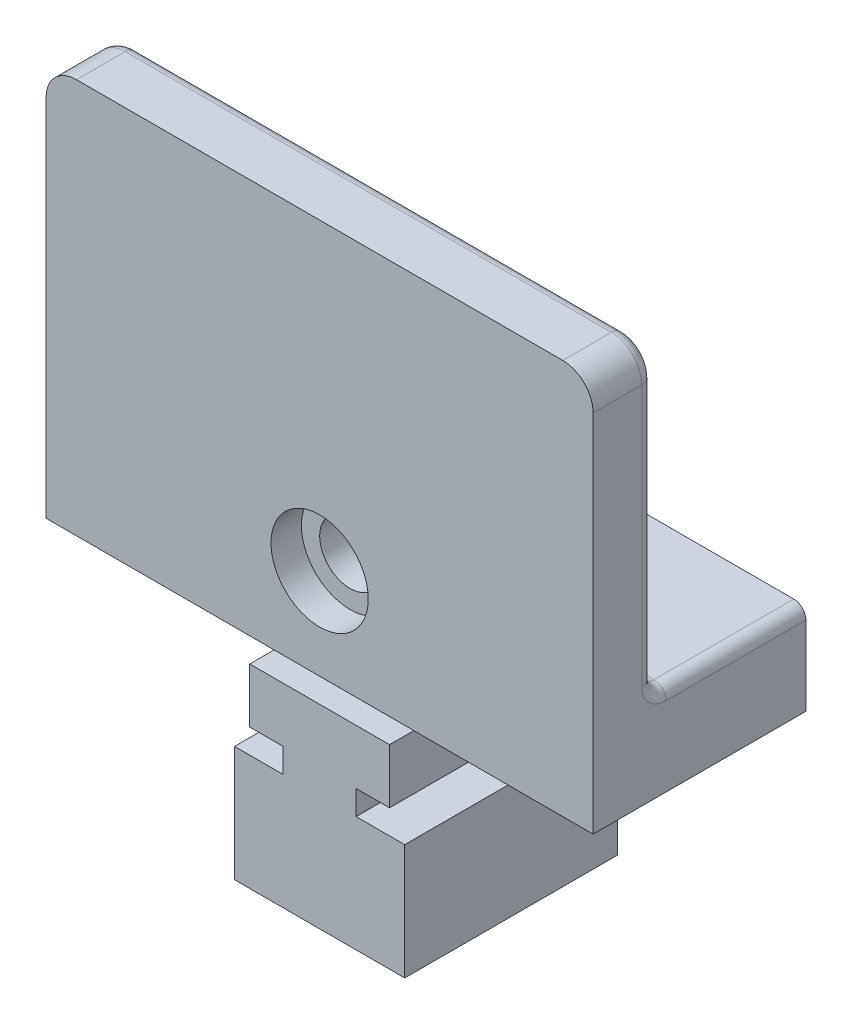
ISO-10303-21;
HEADER;
FILE_DESCRIPTION(('STEP AP214'),'2;1');
FILE_NAME('part.step','',(''),(''),'','','');
FILE_SCHEMA(('AUTOMOTIVE_DESIGN { 1 0 10303 214 1 1 1 1 }'));
ENDSEC;
DATA;
#1=APPLICATION_CONTEXT('core data for automotive mechanical design processes');
#2=APPLICATION_PROTOCOL_DEFINITION('international standard','automotive_design',2000,#1);
#3=PRODUCT_CONTEXT('',#1,'mechanical');
#4=PRODUCT('Part','Part','',(#3));
#5=PRODUCT_RELATED_PRODUCT_CATEGORY('part','',(#4));
#6=PRODUCT_DEFINITION_FORMATION('','',#4);
#7=PRODUCT_DEFINITION_CONTEXT('part definition',#1,'design');
#8=PRODUCT_DEFINITION('design','',#6,#7);
#9=PRODUCT_DEFINITION_SHAPE('','',#8);
#10=(LENGTH_UNIT() NAMED_UNIT(*) SI_UNIT(.MILLI.,.METRE.));
#11=(NAMED_UNIT(*) PLANE_ANGLE_UNIT() SI_UNIT($,.RADIAN.));
#12=(NAMED_UNIT(*) SI_UNIT($,.STERADIAN.) SOLID_ANGLE_UNIT());
#13=UNCERTAINTY_MEASURE_WITH_UNIT(LENGTH_MEASURE(1.E-05),#10,'distance_accuracy_value','');
#14=(GEOMETRIC_REPRESENTATION_CONTEXT(3) GLOBAL_UNCERTAINTY_ASSIGNED_CONTEXT((#13)) GLOBAL_UNIT_ASSIGNED_CONTEXT((#10,
#11,#12)) REPRESENTATION_CONTEXT('',''));
#15=CARTESIAN_POINT('',(0.,0.,0.));
#16=DIRECTION('',(0.,0.,1.));
#17=DIRECTION('',(1.,0.,0.));
#18=AXIS2_PLACEMENT_3D('',#15,#16,#17);
#19=CARTESIAN_POINT('',(-18.8944436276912,57.,25.));
#20=DIRECTION('',(0.,0.,1.));
#21=DIRECTION('',(1.,0.,0.));
#22=AXIS2_PLACEMENT_3D('',#19,#20,#21);
#23=PLANE('',#22);
#24=DIRECTION('',(0.,-1.,0.));
#25=VECTOR('',#24,1.);
#26=CARTESIAN_POINT('',(-11.5,40.,25.));
#27=LINE('',#26,#25);
#28=CARTESIAN_POINT('',(-11.5,40.,25.));
#29=VERTEX_POINT('',#28);
#30=CARTESIAN_POINT('',(-11.5,36.,25.));
#31=VERTEX_POINT('',#30);
#32=EDGE_CURVE('E390',#29,#31,#27,.T.);
#33=ORIENTED_EDGE('',*,*,#32,.T.);
#34=DIRECTION('',(-1.,0.,0.));
#35=VECTOR('',#34,1.);
#36=CARTESIAN_POINT('',(-11.5,36.,25.));
#37=LINE('',#36,#35);
#38=CARTESIAN_POINT('',(11.5,36.,25.));
#39=VERTEX_POINT('',#38);
#40=EDGE_CURVE('E257',#39,#31,#37,.T.);
#41=ORIENTED_EDGE('',*,*,#40,.F.);
#42=DIRECTION('',(0.,1.,0.));
#43=VECTOR('',#42,1.);
#44=CARTESIAN_POINT('',(11.5,40.,25.));
#45=LINE('',#44,#43);
#46=CARTESIAN_POINT('',(11.5,40.,25.));
#47=VERTEX_POINT('',#46);
#48=EDGE_CURVE('E36',#39,#47,#45,.T.);
#49=ORIENTED_EDGE('',*,*,#48,.T.);
#50=DIRECTION('',(1.,0.,0.));
#51=VECTOR('',#50,1.);
#52=CARTESIAN_POINT('',(12.5,40.,25.));
#53=LINE('',#52,#51);
#54=EDGE_CURVE('E442',#29,#47,#53,.T.);
#55=ORIENTED_EDGE('',*,*,#54,.F.);
#56=EDGE_LOOP('',(#33,#41,#49,#55));
#57=FACE_BOUND('',#56,.T.);
#58=ADVANCED_FACE('F32',(#57),#23,.T.);
#59=CARTESIAN_POINT('',(0.,55.,35.));
#60=DIRECTION('',(0.,0.,-1.));
#61=DIRECTION('',(-1.,0.,0.));
#62=AXIS2_PLACEMENT_3D('',#59,#60,#61);
#63=CYLINDRICAL_SURFACE('',#62,5.);
#64=CARTESIAN_POINT('',(0.,55.,0.));
#65=DIRECTION('',(0.,0.,-1.));
#66=DIRECTION('',(-1.,0.,0.));
#67=AXIS2_PLACEMENT_3D('',#64,#65,#66);
#68=CIRCLE('',#67,5.);
#69=CARTESIAN_POINT('',(-5.,55.,0.));
#70=VERTEX_POINT('',#69);
#71=EDGE_CURVE('E308',#70,#70,#68,.T.);
#72=ORIENTED_EDGE('',*,*,#71,.T.);
#73=EDGE_LOOP('',(#72));
#74=FACE_BOUND('',#73,.T.);
#75=CARTESIAN_POINT('',(0.,55.,30.));
#76=DIRECTION('',(0.,0.,1.));
#77=DIRECTION('',(1.,0.,0.));
#78=AXIS2_PLACEMENT_3D('',#75,#76,#77);
#79=CIRCLE('',#78,5.);
#80=CARTESIAN_POINT('',(5.,55.,30.));
#81=VERTEX_POINT('',#80);
#82=EDGE_CURVE('E306',#81,#81,#79,.F.);
#83=ORIENTED_EDGE('',*,*,#82,.F.);
#84=EDGE_LOOP('',(#83));
#85=FACE_BOUND('',#84,.T.);
#86=ADVANCED_FACE('F527',(#74,#85),#63,.F.);
#87=CARTESIAN_POINT('',(-18.8944436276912,57.,25.));
#88=DIRECTION('',(0.,0.,-1.));
#89=DIRECTION('',(-1.,0.,0.));
#90=AXIS2_PLACEMENT_3D('',#87,#88,#89);
#91=CYLINDRICAL_SURFACE('',#90,2.);
#92=DIRECTION('',(0.,0.,-1.));
#93=VECTOR('',#92,1.);
#94=CARTESIAN_POINT('',(-18.8944436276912,55.,25.));
#95=LINE('',#94,#93);
#96=CARTESIAN_POINT('',(-18.8944436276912,55.,23.));
#97=VERTEX_POINT('',#96);
#98=CARTESIAN_POINT('',(-18.8944436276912,55.,0.));
#99=VERTEX_POINT('',#98);
#100=EDGE_CURVE('E440',#97,#99,#95,.T.);
#101=ORIENTED_EDGE('',*,*,#100,.F.);
#102=CARTESIAN_POINT('',(-18.8944436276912,57.,23.));
#103=DIRECTION('',(0.,0.,-1.));
#104=DIRECTION('',(-1.,0.,0.));
#105=AXIS2_PLACEMENT_3D('',#102,#103,#104);
#106=CIRCLE('',#105,2.);
#107=CARTESIAN_POINT('',(-16.9055548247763,56.7894736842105,23.));
#108=VERTEX_POINT('',#107);
#109=EDGE_CURVE('E58',#97,#108,#106,.F.);
#110=ORIENTED_EDGE('',*,*,#109,.T.);
#111=DIRECTION('',(0.,0.,-1.));
#112=VECTOR('',#111,1.);
#113=CARTESIAN_POINT('',(-16.9055548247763,56.7894736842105,25.));
#114=LINE('',#113,#112);
#115=CARTESIAN_POINT('',(-16.9055548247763,56.7894736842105,0.));
#116=VERTEX_POINT('',#115);
#117=EDGE_CURVE('E391',#108,#116,#114,.T.);
#118=ORIENTED_EDGE('',*,*,#117,.T.);
#119=CARTESIAN_POINT('',(-18.8944436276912,57.,0.));
#120=DIRECTION('',(0.,0.,-1.));
#121=DIRECTION('',(1.,0.,0.));
#122=AXIS2_PLACEMENT_3D('',#119,#120,#121);
#123=CIRCLE('',#122,2.);
#124=EDGE_CURVE('E338',#116,#99,#123,.T.);
#125=ORIENTED_EDGE('',*,*,#124,.T.);
#126=EDGE_LOOP('',(#101,#110,#118,#125));
#127=FACE_BOUND('',#126,.T.);
#128=ADVANCED_FACE('F529',(#127),#91,.F.);
#129=CARTESIAN_POINT('',(-18.8944436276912,55.,25.));
#130=DIRECTION('',(0.,-1.,0.));
#131=DIRECTION('',(1.,0.,0.));
#132=AXIS2_PLACEMENT_3D('',#129,#130,#131);
#133=PLANE('',#132);
#134=DIRECTION('',(0.,0.,-1.));
#135=VECTOR('',#134,1.);
#136=CARTESIAN_POINT('',(-43.,55.,25.));
#137=LINE('',#136,#135);
#138=CARTESIAN_POINT('',(-43.,55.,23.));
#139=VERTEX_POINT('',#138);
#140=CARTESIAN_POINT('',(-43.,55.,0.));
#141=VERTEX_POINT('',#140);
#142=EDGE_CURVE('E438',#139,#141,#137,.T.);
#143=ORIENTED_EDGE('',*,*,#142,.F.);
#144=DIRECTION('',(-1.,0.,0.));
#145=VECTOR('',#144,1.);
#146=CARTESIAN_POINT('',(-18.8944436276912,55.,23.));
#147=LINE('',#146,#145);
#148=EDGE_CURVE('E482',#139,#97,#147,.F.);
#149=ORIENTED_EDGE('',*,*,#148,.T.);
#150=ORIENTED_EDGE('',*,*,#100,.T.);
#151=DIRECTION('',(-1.,0.,0.));
#152=VECTOR('',#151,1.);
#153=CARTESIAN_POINT('',(-18.8944436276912,55.,0.));
#154=LINE('',#153,#152);
#155=EDGE_CURVE('E341',#99,#141,#154,.T.);
#156=ORIENTED_EDGE('',*,*,#155,.T.);
#157=EDGE_LOOP('',(#143,#149,#150,#156));
#158=FACE_BOUND('',#157,.T.);
#159=ADVANCED_FACE('F536',(#158),#133,.F.);
#160=CARTESIAN_POINT('',(-43.,53.,25.));
#161=DIRECTION('',(0.,0.,-1.));
#162=DIRECTION('',(-1.,0.,0.));
#163=AXIS2_PLACEMENT_3D('',#160,#161,#162);
#164=CYLINDRICAL_SURFACE('',#163,2.);
#165=DIRECTION('',(0.,0.,-1.));
#166=VECTOR('',#165,1.);
#167=CARTESIAN_POINT('',(-45.,53.,25.));
#168=LINE('',#167,#166);
#169=CARTESIAN_POINT('',(-45.,53.,23.));
#170=VERTEX_POINT('',#169);
#171=CARTESIAN_POINT('',(-45.,53.,0.));
#172=VERTEX_POINT('',#171);
#173=EDGE_CURVE('E437',#170,#172,#168,.T.);
#174=ORIENTED_EDGE('',*,*,#173,.F.);
#175=CARTESIAN_POINT('',(-43.,53.,23.));
#176=DIRECTION('',(0.,0.,-1.));
#177=DIRECTION('',(-1.,0.,0.));
#178=AXIS2_PLACEMENT_3D('',#175,#176,#177);
#179=CIRCLE('',#178,2.);
#180=EDGE_CURVE('E480',#170,#139,#179,.T.);
#181=ORIENTED_EDGE('',*,*,#180,.T.);
#182=ORIENTED_EDGE('',*,*,#142,.T.);
#183=CARTESIAN_POINT('',(-43.,53.,0.));
#184=DIRECTION('',(0.,0.,1.));
#185=DIRECTION('',(1.,0.,0.));
#186=AXIS2_PLACEMENT_3D('',#183,#184,#185);
#187=CIRCLE('',#186,2.);
#188=EDGE_CURVE('E344',#141,#172,#187,.T.);
#189=ORIENTED_EDGE('',*,*,#188,.T.);
#190=EDGE_LOOP('',(#174,#181,#182,#189));
#191=FACE_BOUND('',#190,.T.);
#192=ADVANCED_FACE('F637',(#191),#164,.T.);
#193=CARTESIAN_POINT('',(-45.,53.,25.));
#194=DIRECTION('',(1.,0.,0.));
#195=DIRECTION('',(0.,0.,-1.));
#196=AXIS2_PLACEMENT_3D('',#193,#194,#195);
#197=PLANE('',#196);
#198=DIRECTION('',(0.,-1.,0.));
#199=VECTOR('',#198,1.);
#200=CARTESIAN_POINT('',(-45.,53.,27.));
#201=LINE('',#200,#199);
#202=CARTESIAN_POINT('',(-45.,100.,27.));
#203=VERTEX_POINT('',#202);
#204=CARTESIAN_POINT('',(-45.,57.,27.));
#205=VERTEX_POINT('',#204);
#206=EDGE_CURVE('E470',#203,#205,#201,.T.);
#207=ORIENTED_EDGE('',*,*,#206,.T.);
#208=CARTESIAN_POINT('',(-45.,57.,23.));
#209=DIRECTION('',(1.,0.,0.));
#210=DIRECTION('',(0.,0.,-1.));
#211=AXIS2_PLACEMENT_3D('',#208,#209,#210);
#212=CIRCLE('',#211,4.);
#213=EDGE_CURVE('E42',#205,#170,#212,.T.);
#214=ORIENTED_EDGE('',*,*,#213,.T.);
#215=ORIENTED_EDGE('',*,*,#173,.T.);
#216=DIRECTION('',(0.,-1.,0.));
#217=VECTOR('',#216,1.);
#218=CARTESIAN_POINT('',(-45.,53.,0.));
#219=LINE('',#218,#217);
#220=CARTESIAN_POINT('',(-45.,40.,0.));
#221=VERTEX_POINT('',#220);
#222=EDGE_CURVE('E347',#172,#221,#219,.T.);
#223=ORIENTED_EDGE('',*,*,#222,.T.);
#224=DIRECTION('',(0.,0.,-1.));
#225=VECTOR('',#224,1.);
#226=CARTESIAN_POINT('',(-45.,40.,25.));
#227=LINE('',#226,#225);
#228=CARTESIAN_POINT('',(-45.,40.,35.));
#229=VERTEX_POINT('',#228);
#230=EDGE_CURVE('E434',#229,#221,#227,.T.);
#231=ORIENTED_EDGE('',*,*,#230,.F.);
#232=DIRECTION('',(0.,-1.,0.));
#233=VECTOR('',#232,1.);
#234=CARTESIAN_POINT('',(-45.,100.,35.));
#235=LINE('',#234,#233);
#236=CARTESIAN_POINT('',(-45.,100.,35.));
#237=VERTEX_POINT('',#236);
#238=EDGE_CURVE('E323',#237,#229,#235,.T.);
#239=ORIENTED_EDGE('',*,*,#238,.F.);
#240=DIRECTION('',(0.,0.,-1.));
#241=VECTOR('',#240,1.);
#242=CARTESIAN_POINT('',(-45.,100.,35.));
#243=LINE('',#242,#241);
#244=EDGE_CURVE('E326',#237,#203,#243,.T.);
#245=ORIENTED_EDGE('',*,*,#244,.T.);
#246=EDGE_LOOP('',(#207,#214,#215,#223,#231,#239,#245));
#247=FACE_BOUND('',#246,.T.);
#248=ADVANCED_FACE('F633',(#247),#197,.F.);
#249=CARTESIAN_POINT('',(-11.5,40.,25.));
#250=DIRECTION('',(1.,0.,0.));
#251=DIRECTION('',(0.,1.,0.));
#252=AXIS2_PLACEMENT_3D('',#249,#250,#251);
#253=PLANE('',#252);
#254=DIRECTION('',(0.,-1.,0.));
#255=VECTOR('',#254,1.);
#256=CARTESIAN_POINT('',(-11.5,40.,0.));
#257=LINE('',#256,#255);
#258=CARTESIAN_POINT('',(-11.5,40.,0.));
#259=VERTEX_POINT('',#258);
#260=CARTESIAN_POINT('',(-11.5,27.,0.));
#261=VERTEX_POINT('',#260);
#262=EDGE_CURVE('E351',#259,#261,#257,.T.);
#263=ORIENTED_EDGE('',*,*,#262,.T.);
#264=DIRECTION('',(0.,0.,-1.));
#265=VECTOR('',#264,1.);
#266=CARTESIAN_POINT('',(-11.5,27.,25.));
#267=LINE('',#266,#265);
#268=CARTESIAN_POINT('',(-11.5,27.,35.));
#269=VERTEX_POINT('',#268);
#270=EDGE_CURVE('E430',#269,#261,#267,.T.);
#271=ORIENTED_EDGE('',*,*,#270,.F.);
#272=DIRECTION('',(0.,-1.,0.));
#273=VECTOR('',#272,1.);
#274=CARTESIAN_POINT('',(-11.5,36.,35.));
#275=LINE('',#274,#273);
#276=CARTESIAN_POINT('',(-11.5,36.,35.));
#277=VERTEX_POINT('',#276);
#278=EDGE_CURVE('E266',#277,#269,#275,.T.);
#279=ORIENTED_EDGE('',*,*,#278,.F.);
#280=DIRECTION('',(0.,0.,-1.));
#281=VECTOR('',#280,1.);
#282=CARTESIAN_POINT('',(-11.5,36.,77.5205832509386));
#283=LINE('',#282,#281);
#284=EDGE_CURVE('E258',#277,#31,#283,.T.);
#285=ORIENTED_EDGE('',*,*,#284,.T.);
#286=ORIENTED_EDGE('',*,*,#32,.F.);
#287=DIRECTION('',(0.,0.,-1.));
#288=VECTOR('',#287,1.);
#289=CARTESIAN_POINT('',(-11.5,40.,25.));
#290=LINE('',#289,#288);
#291=EDGE_CURVE('E433',#29,#259,#290,.T.);
#292=ORIENTED_EDGE('',*,*,#291,.T.);
#293=EDGE_LOOP('',(#263,#271,#279,#285,#286,#292));
#294=FACE_BOUND('',#293,.T.);
#295=ADVANCED_FACE('F629',(#294),#253,.F.);
#296=CARTESIAN_POINT('',(-11.5,27.,25.));
#297=DIRECTION('',(0.,1.,0.));
#298=DIRECTION('',(0.,0.,1.));
#299=AXIS2_PLACEMENT_3D('',#296,#297,#298);
#300=PLANE('',#299);
#301=DIRECTION('',(1.,0.,0.));
#302=VECTOR('',#301,1.);
#303=CARTESIAN_POINT('',(-11.5,27.,0.));
#304=LINE('',#303,#302);
#305=CARTESIAN_POINT('',(-6.,27.,0.));
#306=VERTEX_POINT('',#305);
#307=EDGE_CURVE('E353',#261,#306,#304,.T.);
#308=ORIENTED_EDGE('',*,*,#307,.T.);
#309=DIRECTION('',(0.,0.,-1.));
#310=VECTOR('',#309,1.);
#311=CARTESIAN_POINT('',(-6.,27.,25.));
#312=LINE('',#311,#310);
#313=CARTESIAN_POINT('',(-6.,27.,35.));
#314=VERTEX_POINT('',#313);
#315=EDGE_CURVE('E427',#314,#306,#312,.T.);
#316=ORIENTED_EDGE('',*,*,#315,.F.);
#317=DIRECTION('',(1.,0.,0.));
#318=VECTOR('',#317,1.);
#319=CARTESIAN_POINT('',(-11.5,27.,35.));
#320=LINE('',#319,#318);
#321=EDGE_CURVE('E300',#269,#314,#320,.T.);
#322=ORIENTED_EDGE('',*,*,#321,.F.);
#323=ORIENTED_EDGE('',*,*,#270,.T.);
#324=EDGE_LOOP('',(#308,#316,#322,#323));
#325=FACE_BOUND('',#324,.T.);
#326=ADVANCED_FACE('F625',(#325),#300,.F.);
#327=CARTESIAN_POINT('',(-6.,27.,25.));
#328=DIRECTION('',(1.,0.,0.));
#329=DIRECTION('',(0.,1.,0.));
#330=AXIS2_PLACEMENT_3D('',#327,#328,#329);
#331=PLANE('',#330);
#332=DIRECTION('',(0.,-1.,0.));
#333=VECTOR('',#332,1.);
#334=CARTESIAN_POINT('',(-6.,27.,0.));
#335=LINE('',#334,#333);
#336=CARTESIAN_POINT('',(-6.,23.,0.));
#337=VERTEX_POINT('',#336);
#338=EDGE_CURVE('E355',#306,#337,#335,.T.);
#339=ORIENTED_EDGE('',*,*,#338,.T.);
#340=DIRECTION('',(0.,0.,-1.));
#341=VECTOR('',#340,1.);
#342=CARTESIAN_POINT('',(-6.,23.,25.));
#343=LINE('',#342,#341);
#344=CARTESIAN_POINT('',(-6.,23.,35.));
#345=VERTEX_POINT('',#344);
#346=EDGE_CURVE('E424',#345,#337,#343,.T.);
#347=ORIENTED_EDGE('',*,*,#346,.F.);
#348=DIRECTION('',(0.,-1.,0.));
#349=VECTOR('',#348,1.);
#350=CARTESIAN_POINT('',(-6.,27.,35.));
#351=LINE('',#350,#349);
#352=EDGE_CURVE('E297',#314,#345,#351,.T.);
#353=ORIENTED_EDGE('',*,*,#352,.F.);
#354=ORIENTED_EDGE('',*,*,#315,.T.);
#355=EDGE_LOOP('',(#339,#347,#353,#354));
#356=FACE_BOUND('',#355,.T.);
#357=ADVANCED_FACE('F621',(#356),#331,.F.);
#358=CARTESIAN_POINT('',(-6.,23.,25.));
#359=DIRECTION('',(0.,-1.,0.));
#360=DIRECTION('',(0.,0.,-1.));
#361=AXIS2_PLACEMENT_3D('',#358,#359,#360);
#362=PLANE('',#361);
#363=DIRECTION('',(-1.,0.,0.));
#364=VECTOR('',#363,1.);
#365=CARTESIAN_POINT('',(-6.,23.,0.));
#366=LINE('',#365,#364);
#367=CARTESIAN_POINT('',(-14.,23.,0.));
#368=VERTEX_POINT('',#367);
#369=EDGE_CURVE('E357',#337,#368,#366,.T.);
#370=ORIENTED_EDGE('',*,*,#369,.T.);
#371=DIRECTION('',(0.,0.,-1.));
#372=VECTOR('',#371,1.);
#373=CARTESIAN_POINT('',(-14.,23.,25.));
#374=LINE('',#373,#372);
#375=CARTESIAN_POINT('',(-14.,23.,35.));
#376=VERTEX_POINT('',#375);
#377=EDGE_CURVE('E421',#376,#368,#374,.T.);
#378=ORIENTED_EDGE('',*,*,#377,.F.);
#379=DIRECTION('',(-1.,0.,0.));
#380=VECTOR('',#379,1.);
#381=CARTESIAN_POINT('',(-6.,23.,35.));
#382=LINE('',#381,#380);
#383=EDGE_CURVE('E294',#345,#376,#382,.T.);
#384=ORIENTED_EDGE('',*,*,#383,.F.);
#385=ORIENTED_EDGE('',*,*,#346,.T.);
#386=EDGE_LOOP('',(#370,#378,#384,#385));
#387=FACE_BOUND('',#386,.T.);
#388=ADVANCED_FACE('F617',(#387),#362,.F.);
#389=CARTESIAN_POINT('',(-14.,23.,25.));
#390=DIRECTION('',(1.,0.,0.));
#391=DIRECTION('',(0.,0.,-1.));
#392=AXIS2_PLACEMENT_3D('',#389,#390,#391);
#393=PLANE('',#392);
#394=DIRECTION('',(0.,-1.,0.));
#395=VECTOR('',#394,1.);
#396=CARTESIAN_POINT('',(-14.,23.,0.));
#397=LINE('',#396,#395);
#398=CARTESIAN_POINT('',(-14.,4.,0.));
#399=VERTEX_POINT('',#398);
#400=EDGE_CURVE('E359',#368,#399,#397,.T.);
#401=ORIENTED_EDGE('',*,*,#400,.T.);
#402=DIRECTION('',(0.,0.,-1.));
#403=VECTOR('',#402,1.);
#404=CARTESIAN_POINT('',(-14.,4.,25.));
#405=LINE('',#404,#403);
#406=CARTESIAN_POINT('',(-14.,4.,35.));
#407=VERTEX_POINT('',#406);
#408=EDGE_CURVE('E418',#407,#399,#405,.T.);
#409=ORIENTED_EDGE('',*,*,#408,.F.);
#410=DIRECTION('',(0.,-1.,0.));
#411=VECTOR('',#410,1.);
#412=CARTESIAN_POINT('',(-14.,23.,35.));
#413=LINE('',#412,#411);
#414=EDGE_CURVE('E291',#376,#407,#413,.T.);
#415=ORIENTED_EDGE('',*,*,#414,.F.);
#416=ORIENTED_EDGE('',*,*,#377,.T.);
#417=EDGE_LOOP('',(#401,#409,#415,#416));
#418=FACE_BOUND('',#417,.T.);
#419=ADVANCED_FACE('F613',(#418),#393,.F.);
#420=CARTESIAN_POINT('',(-14.,4.,25.));
#421=DIRECTION('',(0.,1.,0.));
#422=DIRECTION('',(0.,0.,1.));
#423=AXIS2_PLACEMENT_3D('',#420,#421,#422);
#424=PLANE('',#423);
#425=DIRECTION('',(1.,0.,0.));
#426=VECTOR('',#425,1.);
#427=CARTESIAN_POINT('',(-14.,4.,0.));
#428=LINE('',#427,#426);
#429=CARTESIAN_POINT('',(14.,4.,0.));
#430=VERTEX_POINT('',#429);
#431=EDGE_CURVE('E361',#399,#430,#428,.T.);
#432=ORIENTED_EDGE('',*,*,#431,.T.);
#433=DIRECTION('',(0.,0.,-1.));
#434=VECTOR('',#433,1.);
#435=CARTESIAN_POINT('',(14.,4.,25.));
#436=LINE('',#435,#434);
#437=CARTESIAN_POINT('',(14.,4.,35.));
#438=VERTEX_POINT('',#437);
#439=EDGE_CURVE('E415',#438,#430,#436,.T.);
#440=ORIENTED_EDGE('',*,*,#439,.F.);
#441=DIRECTION('',(1.,0.,0.));
#442=VECTOR('',#441,1.);
#443=CARTESIAN_POINT('',(-14.,4.,35.));
#444=LINE('',#443,#442);
#445=EDGE_CURVE('E288',#407,#438,#444,.T.);
#446=ORIENTED_EDGE('',*,*,#445,.F.);
#447=ORIENTED_EDGE('',*,*,#408,.T.);
#448=EDGE_LOOP('',(#432,#440,#446,#447));
#449=FACE_BOUND('',#448,.T.);
#450=ADVANCED_FACE('F609',(#449),#424,.F.);
#451=CARTESIAN_POINT('',(14.,23.,25.));
#452=DIRECTION('',(-1.,0.,0.));
#453=DIRECTION('',(0.,0.,1.));
#454=AXIS2_PLACEMENT_3D('',#451,#452,#453);
#455=PLANE('',#454);
#456=DIRECTION('',(0.,1.,0.));
#457=VECTOR('',#456,1.);
#458=CARTESIAN_POINT('',(14.,23.,0.));
#459=LINE('',#458,#457);
#460=CARTESIAN_POINT('',(14.,23.,0.));
#461=VERTEX_POINT('',#460);
#462=EDGE_CURVE('E363',#430,#461,#459,.T.);
#463=ORIENTED_EDGE('',*,*,#462,.T.);
#464=DIRECTION('',(0.,0.,-1.));
#465=VECTOR('',#464,1.);
#466=CARTESIAN_POINT('',(14.,23.,25.));
#467=LINE('',#466,#465);
#468=CARTESIAN_POINT('',(14.,23.,35.));
#469=VERTEX_POINT('',#468);
#470=EDGE_CURVE('E412',#469,#461,#467,.T.);
#471=ORIENTED_EDGE('',*,*,#470,.F.);
#472=DIRECTION('',(0.,1.,0.));
#473=VECTOR('',#472,1.);
#474=CARTESIAN_POINT('',(14.,4.,35.));
#475=LINE('',#474,#473);
#476=EDGE_CURVE('E285',#438,#469,#475,.T.);
#477=ORIENTED_EDGE('',*,*,#476,.F.);
#478=ORIENTED_EDGE('',*,*,#439,.T.);
#479=EDGE_LOOP('',(#463,#471,#477,#478));
#480=FACE_BOUND('',#479,.T.);
#481=ADVANCED_FACE('F605',(#480),#455,.F.);
#482=CARTESIAN_POINT('',(6.,23.,25.));
#483=DIRECTION('',(0.,-1.,0.));
#484=DIRECTION('',(0.,0.,-1.));
#485=AXIS2_PLACEMENT_3D('',#482,#483,#484);
#486=PLANE('',#485);
#487=DIRECTION('',(-1.,0.,0.));
#488=VECTOR('',#487,1.);
#489=CARTESIAN_POINT('',(6.,23.,0.));
#490=LINE('',#489,#488);
#491=CARTESIAN_POINT('',(6.,23.,0.));
#492=VERTEX_POINT('',#491);
#493=EDGE_CURVE('E365',#461,#492,#490,.T.);
#494=ORIENTED_EDGE('',*,*,#493,.T.);
#495=DIRECTION('',(0.,0.,-1.));
#496=VECTOR('',#495,1.);
#497=CARTESIAN_POINT('',(6.,23.,25.));
#498=LINE('',#497,#496);
#499=CARTESIAN_POINT('',(6.,23.,35.));
#500=VERTEX_POINT('',#499);
#501=EDGE_CURVE('E409',#500,#492,#498,.T.);
#502=ORIENTED_EDGE('',*,*,#501,.F.);
#503=DIRECTION('',(-1.,0.,0.));
#504=VECTOR('',#503,1.);
#505=CARTESIAN_POINT('',(14.,23.,35.));
#506=LINE('',#505,#504);
#507=EDGE_CURVE('E282',#469,#500,#506,.T.);
#508=ORIENTED_EDGE('',*,*,#507,.F.);
#509=ORIENTED_EDGE('',*,*,#470,.T.);
#510=EDGE_LOOP('',(#494,#502,#508,#509));
#511=FACE_BOUND('',#510,.T.);
#512=ADVANCED_FACE('F601',(#511),#486,.F.);
#513=CARTESIAN_POINT('',(6.,27.,25.));
#514=DIRECTION('',(-1.,0.,0.));
#515=DIRECTION('',(0.,-1.,0.));
#516=AXIS2_PLACEMENT_3D('',#513,#514,#515);
#517=PLANE('',#516);
#518=DIRECTION('',(0.,1.,0.));
#519=VECTOR('',#518,1.);
#520=CARTESIAN_POINT('',(6.,27.,0.));
#521=LINE('',#520,#519);
#522=CARTESIAN_POINT('',(6.,27.,0.));
#523=VERTEX_POINT('',#522);
#524=EDGE_CURVE('E367',#492,#523,#521,.T.);
#525=ORIENTED_EDGE('',*,*,#524,.T.);
#526=DIRECTION('',(0.,0.,-1.));
#527=VECTOR('',#526,1.);
#528=CARTESIAN_POINT('',(6.,27.,25.));
#529=LINE('',#528,#527);
#530=CARTESIAN_POINT('',(6.,27.,35.));
#531=VERTEX_POINT('',#530);
#532=EDGE_CURVE('E406',#531,#523,#529,.T.);
#533=ORIENTED_EDGE('',*,*,#532,.F.);
#534=DIRECTION('',(0.,1.,0.));
#535=VECTOR('',#534,1.);
#536=CARTESIAN_POINT('',(6.,23.,35.));
#537=LINE('',#536,#535);
#538=EDGE_CURVE('E277',#500,#531,#537,.T.);
#539=ORIENTED_EDGE('',*,*,#538,.F.);
#540=ORIENTED_EDGE('',*,*,#501,.T.);
#541=EDGE_LOOP('',(#525,#533,#539,#540));
#542=FACE_BOUND('',#541,.T.);
#543=ADVANCED_FACE('F597',(#542),#517,.F.);
#544=CARTESIAN_POINT('',(11.5,27.,25.));
#545=DIRECTION('',(0.,1.,0.));
#546=DIRECTION('',(0.,0.,1.));
#547=AXIS2_PLACEMENT_3D('',#544,#545,#546);
#548=PLANE('',#547);
#549=DIRECTION('',(1.,0.,0.));
#550=VECTOR('',#549,1.);
#551=CARTESIAN_POINT('',(11.5,27.,0.));
#552=LINE('',#551,#550);
#553=CARTESIAN_POINT('',(11.5,27.,0.));
#554=VERTEX_POINT('',#553);
#555=EDGE_CURVE('E369',#523,#554,#552,.T.);
#556=ORIENTED_EDGE('',*,*,#555,.T.);
#557=DIRECTION('',(0.,0.,-1.));
#558=VECTOR('',#557,1.);
#559=CARTESIAN_POINT('',(11.5,27.,25.));
#560=LINE('',#559,#558);
#561=CARTESIAN_POINT('',(11.5,27.,35.));
#562=VERTEX_POINT('',#561);
#563=EDGE_CURVE('E404',#562,#554,#560,.T.);
#564=ORIENTED_EDGE('',*,*,#563,.F.);
#565=DIRECTION('',(1.,0.,0.));
#566=VECTOR('',#565,1.);
#567=CARTESIAN_POINT('',(6.,27.,35.));
#568=LINE('',#567,#566);
#569=EDGE_CURVE('E271',#531,#562,#568,.T.);
#570=ORIENTED_EDGE('',*,*,#569,.F.);
#571=ORIENTED_EDGE('',*,*,#532,.T.);
#572=EDGE_LOOP('',(#556,#564,#570,#571));
#573=FACE_BOUND('',#572,.T.);
#574=ADVANCED_FACE('F594',(#573),#548,.F.);
#575=CARTESIAN_POINT('',(11.5,40.,25.));
#576=DIRECTION('',(-1.,0.,0.));
#577=DIRECTION('',(0.,-1.,0.));
#578=AXIS2_PLACEMENT_3D('',#575,#576,#577);
#579=PLANE('',#578);
#580=DIRECTION('',(0.,1.,0.));
#581=VECTOR('',#580,1.);
#582=CARTESIAN_POINT('',(11.5,40.,0.));
#583=LINE('',#582,#581);
#584=CARTESIAN_POINT('',(11.5,40.,0.));
#585=VERTEX_POINT('',#584);
#586=EDGE_CURVE('E371',#554,#585,#583,.T.);
#587=ORIENTED_EDGE('',*,*,#586,.T.);
#588=DIRECTION('',(0.,0.,-1.));
#589=VECTOR('',#588,1.);
#590=CARTESIAN_POINT('',(11.5,40.,25.));
#591=LINE('',#590,#589);
#592=EDGE_CURVE('E403',#47,#585,#591,.T.);
#593=ORIENTED_EDGE('',*,*,#592,.F.);
#594=ORIENTED_EDGE('',*,*,#48,.F.);
#595=DIRECTION('',(0.,0.,-1.));
#596=VECTOR('',#595,1.);
#597=CARTESIAN_POINT('',(11.5,36.,77.5205832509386));
#598=LINE('',#597,#596);
#599=CARTESIAN_POINT('',(11.5,36.,35.));
#600=VERTEX_POINT('',#599);
#601=EDGE_CURVE('E50',#600,#39,#598,.T.);
#602=ORIENTED_EDGE('',*,*,#601,.F.);
#603=DIRECTION('',(0.,1.,0.));
#604=VECTOR('',#603,1.);
#605=CARTESIAN_POINT('',(11.5,27.,35.));
#606=LINE('',#605,#604);
#607=EDGE_CURVE('E254',#562,#600,#606,.T.);
#608=ORIENTED_EDGE('',*,*,#607,.F.);
#609=ORIENTED_EDGE('',*,*,#563,.T.);
#610=EDGE_LOOP('',(#587,#593,#594,#602,#608,#609));
#611=FACE_BOUND('',#610,.T.);
#612=ADVANCED_FACE('F251',(#611),#579,.F.);
#613=CARTESIAN_POINT('',(11.5,40.,25.));
#614=DIRECTION('',(0.,1.,0.));
#615=DIRECTION('',(0.,0.,1.));
#616=AXIS2_PLACEMENT_3D('',#613,#614,#615);
#617=PLANE('',#616);
#618=DIRECTION('',(1.,0.,0.));
#619=VECTOR('',#618,1.);
#620=CARTESIAN_POINT('',(11.5,40.,0.));
#621=LINE('',#620,#619);
#622=CARTESIAN_POINT('',(45.,40.,0.));
#623=VERTEX_POINT('',#622);
#624=EDGE_CURVE('E373',#585,#623,#621,.T.);
#625=ORIENTED_EDGE('',*,*,#624,.T.);
#626=DIRECTION('',(0.,0.,-1.));
#627=VECTOR('',#626,1.);
#628=CARTESIAN_POINT('',(45.,40.,25.));
#629=LINE('',#628,#627);
#630=CARTESIAN_POINT('',(45.,40.,35.));
#631=VERTEX_POINT('',#630);
#632=EDGE_CURVE('E400',#631,#623,#629,.T.);
#633=ORIENTED_EDGE('',*,*,#632,.F.);
#634=DIRECTION('',(1.,0.,0.));
#635=VECTOR('',#634,1.);
#636=CARTESIAN_POINT('',(-45.,40.,35.));
#637=LINE('',#636,#635);
#638=EDGE_CURVE('E311',#229,#631,#637,.T.);
#639=ORIENTED_EDGE('',*,*,#638,.F.);
#640=ORIENTED_EDGE('',*,*,#230,.T.);
#641=DIRECTION('',(1.,0.,0.));
#642=VECTOR('',#641,1.);
#643=CARTESIAN_POINT('',(-45.,40.,0.));
#644=LINE('',#643,#642);
#645=EDGE_CURVE('E349',#221,#259,#644,.T.);
#646=ORIENTED_EDGE('',*,*,#645,.T.);
#647=ORIENTED_EDGE('',*,*,#291,.F.);
#648=ORIENTED_EDGE('',*,*,#54,.T.);
#649=ORIENTED_EDGE('',*,*,#592,.T.);
#650=EDGE_LOOP('',(#625,#633,#639,#640,#646,#647,#648,#649));
#651=FACE_BOUND('',#650,.T.);
#652=ADVANCED_FACE('F587',(#651),#617,.F.);
#653=CARTESIAN_POINT('',(45.,40.,25.));
#654=DIRECTION('',(-1.,0.,0.));
#655=DIRECTION('',(0.,0.,1.));
#656=AXIS2_PLACEMENT_3D('',#653,#654,#655);
#657=PLANE('',#656);
#658=DIRECTION('',(0.,0.,-1.));
#659=VECTOR('',#658,1.);
#660=CARTESIAN_POINT('',(45.,53.,25.));
#661=LINE('',#660,#659);
#662=CARTESIAN_POINT('',(45.,53.,23.));
#663=VERTEX_POINT('',#662);
#664=CARTESIAN_POINT('',(45.,53.,0.));
#665=VERTEX_POINT('',#664);
#666=EDGE_CURVE('E399',#663,#665,#661,.T.);
#667=ORIENTED_EDGE('',*,*,#666,.F.);
#668=CARTESIAN_POINT('',(45.,57.,23.));
#669=DIRECTION('',(-1.,0.,0.));
#670=DIRECTION('',(0.,0.,1.));
#671=AXIS2_PLACEMENT_3D('',#668,#669,#670);
#672=CIRCLE('',#671,4.);
#673=CARTESIAN_POINT('',(45.,57.,27.));
#674=VERTEX_POINT('',#673);
#675=EDGE_CURVE('E11',#663,#674,#672,.T.);
#676=ORIENTED_EDGE('',*,*,#675,.T.);
#677=DIRECTION('',(0.,1.,0.));
#678=VECTOR('',#677,1.);
#679=CARTESIAN_POINT('',(45.,40.,27.));
#680=LINE('',#679,#678);
#681=CARTESIAN_POINT('',(45.,100.,27.));
#682=VERTEX_POINT('',#681);
#683=EDGE_CURVE('E446',#674,#682,#680,.T.);
#684=ORIENTED_EDGE('',*,*,#683,.T.);
#685=DIRECTION('',(0.,0.,-1.));
#686=VECTOR('',#685,1.);
#687=CARTESIAN_POINT('',(45.,100.,35.));
#688=LINE('',#687,#686);
#689=CARTESIAN_POINT('',(45.,100.,35.));
#690=VERTEX_POINT('',#689);
#691=EDGE_CURVE('E335',#690,#682,#688,.T.);
#692=ORIENTED_EDGE('',*,*,#691,.F.);
#693=DIRECTION('',(0.,1.,0.));
#694=VECTOR('',#693,1.);
#695=CARTESIAN_POINT('',(45.,40.,35.));
#696=LINE('',#695,#694);
#697=EDGE_CURVE('E315',#631,#690,#696,.T.);
#698=ORIENTED_EDGE('',*,*,#697,.F.);
#699=ORIENTED_EDGE('',*,*,#632,.T.);
#700=DIRECTION('',(0.,1.,0.));
#701=VECTOR('',#700,1.);
#702=CARTESIAN_POINT('',(45.,40.,0.));
#703=LINE('',#702,#701);
#704=EDGE_CURVE('E375',#623,#665,#703,.T.);
#705=ORIENTED_EDGE('',*,*,#704,.T.);
#706=EDGE_LOOP('',(#667,#676,#684,#692,#698,#699,#705));
#707=FACE_BOUND('',#706,.T.);
#708=ADVANCED_FACE('F583',(#707),#657,.F.);
#709=CARTESIAN_POINT('',(43.,53.,25.));
#710=DIRECTION('',(0.,0.,-1.));
#711=DIRECTION('',(-1.,0.,0.));
#712=AXIS2_PLACEMENT_3D('',#709,#710,#711);
#713=CYLINDRICAL_SURFACE('',#712,2.);
#714=DIRECTION('',(0.,0.,-1.));
#715=VECTOR('',#714,1.);
#716=CARTESIAN_POINT('',(43.,55.,25.));
#717=LINE('',#716,#715);
#718=CARTESIAN_POINT('',(43.,55.,23.));
#719=VERTEX_POINT('',#718);
#720=CARTESIAN_POINT('',(43.,55.,0.));
#721=VERTEX_POINT('',#720);
#722=EDGE_CURVE('E397',#719,#721,#717,.T.);
#723=ORIENTED_EDGE('',*,*,#722,.F.);
#724=CARTESIAN_POINT('',(43.,53.,23.));
#725=DIRECTION('',(0.,0.,-1.));
#726=DIRECTION('',(-1.,0.,0.));
#727=AXIS2_PLACEMENT_3D('',#724,#725,#726);
#728=CIRCLE('',#727,2.);
#729=EDGE_CURVE('E474',#719,#663,#728,.T.);
#730=ORIENTED_EDGE('',*,*,#729,.T.);
#731=ORIENTED_EDGE('',*,*,#666,.T.);
#732=CARTESIAN_POINT('',(43.,53.,0.));
#733=DIRECTION('',(0.,0.,1.));
#734=DIRECTION('',(1.,0.,0.));
#735=AXIS2_PLACEMENT_3D('',#732,#733,#734);
#736=CIRCLE('',#735,2.);
#737=EDGE_CURVE('E378',#665,#721,#736,.T.);
#738=ORIENTED_EDGE('',*,*,#737,.T.);
#739=EDGE_LOOP('',(#723,#730,#731,#738));
#740=FACE_BOUND('',#739,.T.);
#741=ADVANCED_FACE('F579',(#740),#713,.T.);
#742=CARTESIAN_POINT('',(43.,55.,25.));
#743=DIRECTION('',(0.,-1.,0.));
#744=DIRECTION('',(1.,0.,0.));
#745=AXIS2_PLACEMENT_3D('',#742,#743,#744);
#746=PLANE('',#745);
#747=DIRECTION('',(0.,0.,-1.));
#748=VECTOR('',#747,1.);
#749=CARTESIAN_POINT('',(18.8944436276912,55.,25.));
#750=LINE('',#749,#748);
#751=CARTESIAN_POINT('',(18.8944436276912,55.,23.));
#752=VERTEX_POINT('',#751);
#753=CARTESIAN_POINT('',(18.8944436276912,55.,0.));
#754=VERTEX_POINT('',#753);
#755=EDGE_CURVE('E395',#752,#754,#750,.T.);
#756=ORIENTED_EDGE('',*,*,#755,.F.);
#757=DIRECTION('',(-1.,0.,0.));
#758=VECTOR('',#757,1.);
#759=CARTESIAN_POINT('',(43.,55.,23.));
#760=LINE('',#759,#758);
#761=EDGE_CURVE('E476',#752,#719,#760,.F.);
#762=ORIENTED_EDGE('',*,*,#761,.T.);
#763=ORIENTED_EDGE('',*,*,#722,.T.);
#764=DIRECTION('',(-1.,0.,0.));
#765=VECTOR('',#764,1.);
#766=CARTESIAN_POINT('',(43.,55.,0.));
#767=LINE('',#766,#765);
#768=EDGE_CURVE('E381',#721,#754,#767,.T.);
#769=ORIENTED_EDGE('',*,*,#768,.T.);
#770=EDGE_LOOP('',(#756,#762,#763,#769));
#771=FACE_BOUND('',#770,.T.);
#772=ADVANCED_FACE('F575',(#771),#746,.F.);
#773=CARTESIAN_POINT('',(18.8944436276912,57.,25.));
#774=DIRECTION('',(0.,0.,-1.));
#775=DIRECTION('',(-1.,0.,0.));
#776=AXIS2_PLACEMENT_3D('',#773,#774,#775);
#777=CYLINDRICAL_SURFACE('',#776,2.);
#778=DIRECTION('',(0.,0.,-1.));
#779=VECTOR('',#778,1.);
#780=CARTESIAN_POINT('',(16.9055548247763,56.7894736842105,25.));
#781=LINE('',#780,#779);
#782=CARTESIAN_POINT('',(16.9055548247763,56.7894736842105,23.));
#783=VERTEX_POINT('',#782);
#784=CARTESIAN_POINT('',(16.9055548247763,56.7894736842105,0.));
#785=VERTEX_POINT('',#784);
#786=EDGE_CURVE('E393',#783,#785,#781,.T.);
#787=ORIENTED_EDGE('',*,*,#786,.F.);
#788=CARTESIAN_POINT('',(18.8944436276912,57.,23.));
#789=DIRECTION('',(0.,0.,-1.));
#790=DIRECTION('',(-1.,0.,0.));
#791=AXIS2_PLACEMENT_3D('',#788,#789,#790);
#792=CIRCLE('',#791,2.);
#793=EDGE_CURVE('E478',#783,#752,#792,.F.);
#794=ORIENTED_EDGE('',*,*,#793,.T.);
#795=ORIENTED_EDGE('',*,*,#755,.T.);
#796=CARTESIAN_POINT('',(18.8944436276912,57.,0.));
#797=DIRECTION('',(0.,0.,-1.));
#798=DIRECTION('',(1.,0.,0.));
#799=AXIS2_PLACEMENT_3D('',#796,#797,#798);
#800=CIRCLE('',#799,2.);
#801=EDGE_CURVE('E384',#754,#785,#800,.T.);
#802=ORIENTED_EDGE('',*,*,#801,.T.);
#803=EDGE_LOOP('',(#787,#794,#795,#802));
#804=FACE_BOUND('',#803,.T.);
#805=ADVANCED_FACE('F571',(#804),#777,.F.);
#806=CARTESIAN_POINT('',(0.,55.,25.));
#807=DIRECTION('',(0.,0.,-1.));
#808=DIRECTION('',(-1.,0.,0.));
#809=AXIS2_PLACEMENT_3D('',#806,#807,#808);
#810=CYLINDRICAL_SURFACE('',#809,17.);
#811=ORIENTED_EDGE('',*,*,#117,.F.);
#812=CARTESIAN_POINT('',(0.,55.,23.));
#813=DIRECTION('',(0.,0.,1.));
#814=DIRECTION('',(1.,0.,0.));
#815=AXIS2_PLACEMENT_3D('',#812,#813,#814);
#816=CIRCLE('',#815,17.);
#817=EDGE_CURVE('E487',#108,#783,#816,.F.);
#818=ORIENTED_EDGE('',*,*,#817,.T.);
#819=ORIENTED_EDGE('',*,*,#786,.T.);
#820=CARTESIAN_POINT('',(0.,55.,0.));
#821=DIRECTION('',(0.,0.,1.));
#822=DIRECTION('',(1.,0.,0.));
#823=AXIS2_PLACEMENT_3D('',#820,#821,#822);
#824=CIRCLE('',#823,17.);
#825=EDGE_CURVE('E387',#785,#116,#824,.T.);
#826=ORIENTED_EDGE('',*,*,#825,.T.);
#827=EDGE_LOOP('',(#811,#818,#819,#826));
#828=FACE_BOUND('',#827,.T.);
#829=ADVANCED_FACE('F567',(#828),#810,.T.);
#830=CARTESIAN_POINT('',(-18.8944436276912,57.,0.));
#831=DIRECTION('',(0.,0.,1.));
#832=DIRECTION('',(1.,0.,0.));
#833=AXIS2_PLACEMENT_3D('',#830,#831,#832);
#834=PLANE('',#833);
#835=ORIENTED_EDGE('',*,*,#71,.F.);
#836=EDGE_LOOP('',(#835));
#837=FACE_BOUND('',#836,.T.);
#838=ORIENTED_EDGE('',*,*,#124,.F.);
#839=ORIENTED_EDGE('',*,*,#825,.F.);
#840=ORIENTED_EDGE('',*,*,#801,.F.);
#841=ORIENTED_EDGE('',*,*,#768,.F.);
#842=ORIENTED_EDGE('',*,*,#737,.F.);
#843=ORIENTED_EDGE('',*,*,#704,.F.);
#844=ORIENTED_EDGE('',*,*,#624,.F.);
#845=ORIENTED_EDGE('',*,*,#586,.F.);
#846=ORIENTED_EDGE('',*,*,#555,.F.);
#847=ORIENTED_EDGE('',*,*,#524,.F.);
#848=ORIENTED_EDGE('',*,*,#493,.F.);
#849=ORIENTED_EDGE('',*,*,#462,.F.);
#850=ORIENTED_EDGE('',*,*,#431,.F.);
#851=ORIENTED_EDGE('',*,*,#400,.F.);
#852=ORIENTED_EDGE('',*,*,#369,.F.);
#853=ORIENTED_EDGE('',*,*,#338,.F.);
#854=ORIENTED_EDGE('',*,*,#307,.F.);
#855=ORIENTED_EDGE('',*,*,#262,.F.);
#856=ORIENTED_EDGE('',*,*,#645,.F.);
#857=ORIENTED_EDGE('',*,*,#222,.F.);
#858=ORIENTED_EDGE('',*,*,#188,.F.);
#859=ORIENTED_EDGE('',*,*,#155,.F.);
#860=EDGE_LOOP('',(#838,#839,#840,#841,#842,#843,#844,#845,#846,#847,#848,#849,#850,#851,#852,
#853,#854,#855,#856,#857,#858,#859));
#861=FACE_BOUND('',#860,.T.);
#862=ADVANCED_FACE('F553',(#837,#861),#834,.F.);
#863=CARTESIAN_POINT('',(40.,100.,25.));
#864=DIRECTION('',(0.,0.,1.));
#865=DIRECTION('',(1.,0.,0.));
#866=AXIS2_PLACEMENT_3D('',#863,#864,#865);
#867=PLANE('',#866);
#868=CARTESIAN_POINT('',(-40.,100.,25.));
#869=DIRECTION('',(0.,0.,1.));
#870=DIRECTION('',(1.,0.,0.));
#871=AXIS2_PLACEMENT_3D('',#868,#869,#870);
#872=CIRCLE('',#871,3.);
#873=CARTESIAN_POINT('',(-43.,100.,25.));
#874=VERTEX_POINT('',#873);
#875=CARTESIAN_POINT('',(-40.,103.,25.));
#876=VERTEX_POINT('',#875);
#877=EDGE_CURVE('E723',#874,#876,#872,.F.);
#878=ORIENTED_EDGE('',*,*,#877,.T.);
#879=DIRECTION('',(-1.,0.,0.));
#880=VECTOR('',#879,1.);
#881=CARTESIAN_POINT('',(40.,103.,25.));
#882=LINE('',#881,#880);
#883=CARTESIAN_POINT('',(40.,103.,25.));
#884=VERTEX_POINT('',#883);
#885=EDGE_CURVE('E726',#876,#884,#882,.F.);
#886=ORIENTED_EDGE('',*,*,#885,.T.);
#887=CARTESIAN_POINT('',(40.,100.,25.));
#888=DIRECTION('',(0.,0.,1.));
#889=DIRECTION('',(1.,0.,0.));
#890=AXIS2_PLACEMENT_3D('',#887,#888,#889);
#891=CIRCLE('',#890,3.);
#892=CARTESIAN_POINT('',(43.,100.,25.));
#893=VERTEX_POINT('',#892);
#894=EDGE_CURVE('E725',#884,#893,#891,.F.);
#895=ORIENTED_EDGE('',*,*,#894,.T.);
#896=DIRECTION('',(0.,1.,0.));
#897=VECTOR('',#896,1.);
#898=CARTESIAN_POINT('',(43.,100.,25.));
#899=LINE('',#898,#897);
#900=CARTESIAN_POINT('',(43.,57.,25.));
#901=VERTEX_POINT('',#900);
#902=EDGE_CURVE('E720',#893,#901,#899,.F.);
#903=ORIENTED_EDGE('',*,*,#902,.T.);
#904=DIRECTION('',(-1.,0.,0.));
#905=VECTOR('',#904,1.);
#906=CARTESIAN_POINT('',(18.8944436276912,57.,25.));
#907=LINE('',#906,#905);
#908=CARTESIAN_POINT('',(18.8944436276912,57.,25.));
#909=VERTEX_POINT('',#908);
#910=EDGE_CURVE('E711',#901,#909,#907,.T.);
#911=ORIENTED_EDGE('',*,*,#910,.T.);
#912=CARTESIAN_POINT('',(0.,55.,25.));
#913=DIRECTION('',(0.,0.,1.));
#914=DIRECTION('',(1.,0.,0.));
#915=AXIS2_PLACEMENT_3D('',#912,#913,#914);
#916=CIRCLE('',#915,19.);
#917=CARTESIAN_POINT('',(-18.8944436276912,57.,25.));
#918=VERTEX_POINT('',#917);
#919=EDGE_CURVE('E712',#909,#918,#916,.T.);
#920=ORIENTED_EDGE('',*,*,#919,.T.);
#921=DIRECTION('',(-1.,0.,0.));
#922=VECTOR('',#921,1.);
#923=CARTESIAN_POINT('',(-43.,57.,25.));
#924=LINE('',#923,#922);
#925=CARTESIAN_POINT('',(-43.,57.,25.));
#926=VERTEX_POINT('',#925);
#927=EDGE_CURVE('E709',#918,#926,#924,.T.);
#928=ORIENTED_EDGE('',*,*,#927,.T.);
#929=DIRECTION('',(0.,-1.,0.));
#930=VECTOR('',#929,1.);
#931=CARTESIAN_POINT('',(-43.,100.,25.));
#932=LINE('',#931,#930);
#933=EDGE_CURVE('E714',#926,#874,#932,.F.);
#934=ORIENTED_EDGE('',*,*,#933,.T.);
#935=EDGE_LOOP('',(#878,#886,#895,#903,#911,#920,#928,#934));
#936=FACE_BOUND('',#935,.T.);
#937=ADVANCED_FACE('F549',(#936),#867,.F.);
#938=CARTESIAN_POINT('',(40.,100.,35.));
#939=DIRECTION('',(0.,0.,-1.));
#940=DIRECTION('',(-1.,0.,0.));
#941=AXIS2_PLACEMENT_3D('',#938,#939,#940);
#942=CYLINDRICAL_SURFACE('',#941,5.);
#943=ORIENTED_EDGE('',*,*,#691,.T.);
#944=CARTESIAN_POINT('',(40.,100.,27.));
#945=DIRECTION('',(0.,0.,1.));
#946=DIRECTION('',(1.,0.,0.));
#947=AXIS2_PLACEMENT_3D('',#944,#945,#946);
#948=CIRCLE('',#947,5.);
#949=CARTESIAN_POINT('',(40.,105.,27.));
#950=VERTEX_POINT('',#949);
#951=EDGE_CURVE('E468',#682,#950,#948,.T.);
#952=ORIENTED_EDGE('',*,*,#951,.T.);
#953=DIRECTION('',(0.,0.,-1.));
#954=VECTOR('',#953,1.);
#955=CARTESIAN_POINT('',(40.,105.,35.));
#956=LINE('',#955,#954);
#957=CARTESIAN_POINT('',(40.,105.,35.));
#958=VERTEX_POINT('',#957);
#959=EDGE_CURVE('E332',#958,#950,#956,.T.);
#960=ORIENTED_EDGE('',*,*,#959,.F.);
#961=CARTESIAN_POINT('',(40.,100.,35.));
#962=DIRECTION('',(0.,0.,1.));
#963=DIRECTION('',(1.,0.,0.));
#964=AXIS2_PLACEMENT_3D('',#961,#962,#963);
#965=CIRCLE('',#964,5.);
#966=EDGE_CURVE('E317',#690,#958,#965,.T.);
#967=ORIENTED_EDGE('',*,*,#966,.F.);
#968=EDGE_LOOP('',(#943,#952,#960,#967));
#969=FACE_BOUND('',#968,.T.);
#970=ADVANCED_FACE('F552',(#969),#942,.T.);
#971=CARTESIAN_POINT('',(40.,105.,35.));
#972=DIRECTION('',(0.,-1.,0.));
#973=DIRECTION('',(0.,0.,-1.));
#974=AXIS2_PLACEMENT_3D('',#971,#972,#973);
#975=PLANE('',#974);
#976=ORIENTED_EDGE('',*,*,#959,.T.);
#977=DIRECTION('',(-1.,0.,0.));
#978=VECTOR('',#977,1.);
#979=CARTESIAN_POINT('',(40.,105.,27.));
#980=LINE('',#979,#978);
#981=CARTESIAN_POINT('',(-40.,105.,27.));
#982=VERTEX_POINT('',#981);
#983=EDGE_CURVE('E485',#950,#982,#980,.T.);
#984=ORIENTED_EDGE('',*,*,#983,.T.);
#985=DIRECTION('',(0.,0.,-1.));
#986=VECTOR('',#985,1.);
#987=CARTESIAN_POINT('',(-40.,105.,35.));
#988=LINE('',#987,#986);
#989=CARTESIAN_POINT('',(-40.,105.,35.));
#990=VERTEX_POINT('',#989);
#991=EDGE_CURVE('E329',#990,#982,#988,.T.);
#992=ORIENTED_EDGE('',*,*,#991,.F.);
#993=DIRECTION('',(-1.,0.,0.));
#994=VECTOR('',#993,1.);
#995=CARTESIAN_POINT('',(40.,105.,35.));
#996=LINE('',#995,#994);
#997=EDGE_CURVE('E319',#958,#990,#996,.T.);
#998=ORIENTED_EDGE('',*,*,#997,.F.);
#999=EDGE_LOOP('',(#976,#984,#992,#998));
#1000=FACE_BOUND('',#999,.T.);
#1001=ADVANCED_FACE('F557',(#1000),#975,.F.);
#1002=CARTESIAN_POINT('',(-40.,100.,35.));
#1003=DIRECTION('',(0.,0.,-1.));
#1004=DIRECTION('',(-1.,0.,0.));
#1005=AXIS2_PLACEMENT_3D('',#1002,#1003,#1004);
#1006=CYLINDRICAL_SURFACE('',#1005,5.);
#1007=ORIENTED_EDGE('',*,*,#991,.T.);
#1008=CARTESIAN_POINT('',(-40.,100.,27.));
#1009=DIRECTION('',(0.,0.,1.));
#1010=DIRECTION('',(1.,0.,0.));
#1011=AXIS2_PLACEMENT_3D('',#1008,#1009,#1010);
#1012=CIRCLE('',#1011,5.);
#1013=EDGE_CURVE('E472',#982,#203,#1012,.T.);
#1014=ORIENTED_EDGE('',*,*,#1013,.T.);
#1015=ORIENTED_EDGE('',*,*,#244,.F.);
#1016=CARTESIAN_POINT('',(-40.,100.,35.));
#1017=DIRECTION('',(0.,0.,1.));
#1018=DIRECTION('',(1.,0.,0.));
#1019=AXIS2_PLACEMENT_3D('',#1016,#1017,#1018);
#1020=CIRCLE('',#1019,5.);
#1021=EDGE_CURVE('E321',#990,#237,#1020,.T.);
#1022=ORIENTED_EDGE('',*,*,#1021,.F.);
#1023=EDGE_LOOP('',(#1007,#1014,#1015,#1022));
#1024=FACE_BOUND('',#1023,.T.);
#1025=ADVANCED_FACE('F547',(#1024),#1006,.T.);
#1026=CARTESIAN_POINT('',(40.,100.,35.));
#1027=DIRECTION('',(0.,0.,1.));
#1028=DIRECTION('',(1.,0.,0.));
#1029=AXIS2_PLACEMENT_3D('',#1026,#1027,#1028);
#1030=PLANE('',#1029);
#1031=CARTESIAN_POINT('',(0.,55.,35.));
#1032=DIRECTION('',(0.,0.,1.));
#1033=DIRECTION('',(1.,0.,0.));
#1034=AXIS2_PLACEMENT_3D('',#1031,#1032,#1033);
#1035=CIRCLE('',#1034,8.);
#1036=CARTESIAN_POINT('',(8.,55.,35.));
#1037=VERTEX_POINT('',#1036);
#1038=EDGE_CURVE('E272',#1037,#1037,#1035,.T.);
#1039=ORIENTED_EDGE('',*,*,#1038,.F.);
#1040=EDGE_LOOP('',(#1039));
#1041=FACE_BOUND('',#1040,.T.);
#1042=ORIENTED_EDGE('',*,*,#638,.T.);
#1043=ORIENTED_EDGE('',*,*,#697,.T.);
#1044=ORIENTED_EDGE('',*,*,#966,.T.);
#1045=ORIENTED_EDGE('',*,*,#997,.T.);
#1046=ORIENTED_EDGE('',*,*,#1021,.T.);
#1047=ORIENTED_EDGE('',*,*,#238,.T.);
#1048=EDGE_LOOP('',(#1042,#1043,#1044,#1045,#1046,#1047));
#1049=FACE_BOUND('',#1048,.T.);
#1050=ADVANCED_FACE('F544',(#1041,#1049),#1030,.T.);
#1051=CARTESIAN_POINT('',(40.,57.,23.));
#1052=DIRECTION('',(1.,0.,0.));
#1053=DIRECTION('',(0.,1.,0.));
#1054=AXIS2_PLACEMENT_3D('',#1051,#1052,#1053);
#1055=CYLINDRICAL_SURFACE('',#1054,2.);
#1056=CARTESIAN_POINT('',(-18.8944436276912,57.,23.));
#1057=DIRECTION('',(-1.,0.,0.));
#1058=DIRECTION('',(0.,0.,1.));
#1059=AXIS2_PLACEMENT_3D('',#1056,#1057,#1058);
#1060=CIRCLE('',#1059,2.);
#1061=EDGE_CURVE('E312',#97,#918,#1060,.T.);
#1062=ORIENTED_EDGE('',*,*,#1061,.F.);
#1063=ORIENTED_EDGE('',*,*,#148,.F.);
#1064=CARTESIAN_POINT('',(-43.,57.,23.));
#1065=DIRECTION('',(1.,0.,0.));
#1066=DIRECTION('',(0.,0.,-1.));
#1067=AXIS2_PLACEMENT_3D('',#1064,#1065,#1066);
#1068=CIRCLE('',#1067,2.);
#1069=EDGE_CURVE('E518',#926,#139,#1068,.T.);
#1070=ORIENTED_EDGE('',*,*,#1069,.F.);
#1071=ORIENTED_EDGE('',*,*,#927,.F.);
#1072=EDGE_LOOP('',(#1062,#1063,#1070,#1071));
#1073=FACE_BOUND('',#1072,.T.);
#1074=ADVANCED_FACE('F34',(#1073),#1055,.F.);
#1075=CARTESIAN_POINT('',(-18.8944436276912,57.,23.));
#1076=DIRECTION('',(0.,0.,1.));
#1077=DIRECTION('',(1.,0.,0.));
#1078=AXIS2_PLACEMENT_3D('',#1075,#1076,#1077);
#1079=SPHERICAL_SURFACE('',#1078,2.);
#1080=ORIENTED_EDGE('',*,*,#109,.F.);
#1081=ORIENTED_EDGE('',*,*,#1061,.T.);
#1082=CARTESIAN_POINT('',(-18.8944436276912,57.,23.));
#1083=DIRECTION('',(-0.105263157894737,-0.994444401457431,0.));
#1084=DIRECTION('',(0.994444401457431,-0.105263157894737,0.));
#1085=AXIS2_PLACEMENT_3D('',#1082,#1083,#1084);
#1086=CIRCLE('',#1085,2.);
#1087=EDGE_CURVE('E515',#108,#918,#1086,.T.);
#1088=ORIENTED_EDGE('',*,*,#1087,.F.);
#1089=EDGE_LOOP('',(#1080,#1081,#1088));
#1090=FACE_BOUND('',#1089,.T.);
#1091=ADVANCED_FACE('F683',(#1090),#1079,.F.);
#1092=CARTESIAN_POINT('',(-43.,57.,23.));
#1093=DIRECTION('',(1.,0.,0.));
#1094=DIRECTION('',(0.,0.,-1.));
#1095=AXIS2_PLACEMENT_3D('',#1092,#1093,#1094);
#1096=TOROIDAL_SURFACE('',#1095,4.,2.);
#1097=ORIENTED_EDGE('',*,*,#180,.F.);
#1098=ORIENTED_EDGE('',*,*,#213,.F.);
#1099=CARTESIAN_POINT('',(-43.,57.,27.));
#1100=DIRECTION('',(0.,-1.,0.));
#1101=DIRECTION('',(0.,0.,-1.));
#1102=AXIS2_PLACEMENT_3D('',#1099,#1100,#1101);
#1103=CIRCLE('',#1102,2.);
#1104=EDGE_CURVE('E512',#926,#205,#1103,.F.);
#1105=ORIENTED_EDGE('',*,*,#1104,.F.);
#1106=ORIENTED_EDGE('',*,*,#1069,.T.);
#1107=EDGE_LOOP('',(#1097,#1098,#1105,#1106));
#1108=FACE_BOUND('',#1107,.T.);
#1109=ADVANCED_FACE('F680',(#1108),#1096,.T.);
#1110=CARTESIAN_POINT('',(0.,55.,23.));
#1111=DIRECTION('',(0.,0.,1.));
#1112=DIRECTION('',(1.,0.,0.));
#1113=AXIS2_PLACEMENT_3D('',#1110,#1111,#1112);
#1114=TOROIDAL_SURFACE('',#1113,19.,2.);
#1115=ORIENTED_EDGE('',*,*,#1087,.T.);
#1116=ORIENTED_EDGE('',*,*,#919,.F.);
#1117=CARTESIAN_POINT('',(18.8944436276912,57.,23.));
#1118=DIRECTION('',(-0.105263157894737,0.994444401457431,0.));
#1119=DIRECTION('',(-0.994444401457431,-0.105263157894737,0.));
#1120=AXIS2_PLACEMENT_3D('',#1117,#1118,#1119);
#1121=CIRCLE('',#1120,2.);
#1122=EDGE_CURVE('E509',#783,#909,#1121,.T.);
#1123=ORIENTED_EDGE('',*,*,#1122,.F.);
#1124=ORIENTED_EDGE('',*,*,#817,.F.);
#1125=EDGE_LOOP('',(#1115,#1116,#1123,#1124));
#1126=FACE_BOUND('',#1125,.T.);
#1127=ADVANCED_FACE('F676',(#1126),#1114,.F.);
#1128=CARTESIAN_POINT('',(-43.,53.,27.));
#1129=DIRECTION('',(0.,-1.,0.));
#1130=DIRECTION('',(0.,0.,-1.));
#1131=AXIS2_PLACEMENT_3D('',#1128,#1129,#1130);
#1132=CYLINDRICAL_SURFACE('',#1131,2.);
#1133=ORIENTED_EDGE('',*,*,#1104,.T.);
#1134=ORIENTED_EDGE('',*,*,#206,.F.);
#1135=CARTESIAN_POINT('',(-43.,100.,27.));
#1136=DIRECTION('',(0.,1.,0.));
#1137=DIRECTION('',(0.,0.,1.));
#1138=AXIS2_PLACEMENT_3D('',#1135,#1136,#1137);
#1139=CIRCLE('',#1138,2.);
#1140=EDGE_CURVE('E506',#874,#203,#1139,.T.);
#1141=ORIENTED_EDGE('',*,*,#1140,.F.);
#1142=ORIENTED_EDGE('',*,*,#933,.F.);
#1143=EDGE_LOOP('',(#1133,#1134,#1141,#1142));
#1144=FACE_BOUND('',#1143,.T.);
#1145=ADVANCED_FACE('F672',(#1144),#1132,.T.);
#1146=CARTESIAN_POINT('',(18.8944436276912,57.,23.));
#1147=DIRECTION('',(0.,0.,1.));
#1148=DIRECTION('',(1.,0.,0.));
#1149=AXIS2_PLACEMENT_3D('',#1146,#1147,#1148);
#1150=SPHERICAL_SURFACE('',#1149,2.);
#1151=ORIENTED_EDGE('',*,*,#793,.F.);
#1152=ORIENTED_EDGE('',*,*,#1122,.T.);
#1153=CARTESIAN_POINT('',(18.8944436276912,57.,23.));
#1154=DIRECTION('',(-1.,0.,0.));
#1155=DIRECTION('',(0.,0.,1.));
#1156=AXIS2_PLACEMENT_3D('',#1153,#1154,#1155);
#1157=CIRCLE('',#1156,2.);
#1158=EDGE_CURVE('E503',#752,#909,#1157,.T.);
#1159=ORIENTED_EDGE('',*,*,#1158,.F.);
#1160=EDGE_LOOP('',(#1151,#1152,#1159));
#1161=FACE_BOUND('',#1160,.T.);
#1162=ADVANCED_FACE('F668',(#1161),#1150,.F.);
#1163=CARTESIAN_POINT('',(-40.,100.,27.));
#1164=DIRECTION('',(0.,0.,1.));
#1165=DIRECTION('',(1.,0.,0.));
#1166=AXIS2_PLACEMENT_3D('',#1163,#1164,#1165);
#1167=TOROIDAL_SURFACE('',#1166,3.,2.);
#1168=ORIENTED_EDGE('',*,*,#1140,.T.);
#1169=ORIENTED_EDGE('',*,*,#1013,.F.);
#1170=CARTESIAN_POINT('',(-40.,103.,27.));
#1171=DIRECTION('',(1.,0.,0.));
#1172=DIRECTION('',(0.,0.,-1.));
#1173=AXIS2_PLACEMENT_3D('',#1170,#1171,#1172);
#1174=CIRCLE('',#1173,2.);
#1175=EDGE_CURVE('E500',#876,#982,#1174,.T.);
#1176=ORIENTED_EDGE('',*,*,#1175,.F.);
#1177=ORIENTED_EDGE('',*,*,#877,.F.);
#1178=EDGE_LOOP('',(#1168,#1169,#1176,#1177));
#1179=FACE_BOUND('',#1178,.T.);
#1180=ADVANCED_FACE('F664',(#1179),#1167,.T.);
#1181=CARTESIAN_POINT('',(40.,57.,23.));
#1182=DIRECTION('',(1.,0.,0.));
#1183=DIRECTION('',(0.,1.,0.));
#1184=AXIS2_PLACEMENT_3D('',#1181,#1182,#1183);
#1185=CYLINDRICAL_SURFACE('',#1184,2.);
#1186=ORIENTED_EDGE('',*,*,#1158,.T.);
#1187=ORIENTED_EDGE('',*,*,#910,.F.);
#1188=CARTESIAN_POINT('',(43.,57.,23.));
#1189=DIRECTION('',(-1.,0.,0.));
#1190=DIRECTION('',(0.,0.,1.));
#1191=AXIS2_PLACEMENT_3D('',#1188,#1189,#1190);
#1192=CIRCLE('',#1191,2.);
#1193=EDGE_CURVE('E497',#719,#901,#1192,.T.);
#1194=ORIENTED_EDGE('',*,*,#1193,.F.);
#1195=ORIENTED_EDGE('',*,*,#761,.F.);
#1196=EDGE_LOOP('',(#1186,#1187,#1194,#1195));
#1197=FACE_BOUND('',#1196,.T.);
#1198=ADVANCED_FACE('F660',(#1197),#1185,.F.);
#1199=CARTESIAN_POINT('',(40.,103.,27.));
#1200=DIRECTION('',(-1.,0.,0.));
#1201=DIRECTION('',(0.,0.,1.));
#1202=AXIS2_PLACEMENT_3D('',#1199,#1200,#1201);
#1203=CYLINDRICAL_SURFACE('',#1202,2.);
#1204=ORIENTED_EDGE('',*,*,#1175,.T.);
#1205=ORIENTED_EDGE('',*,*,#983,.F.);
#1206=CARTESIAN_POINT('',(40.,103.,27.));
#1207=DIRECTION('',(1.,0.,0.));
#1208=DIRECTION('',(0.,1.,0.));
#1209=AXIS2_PLACEMENT_3D('',#1206,#1207,#1208);
#1210=CIRCLE('',#1209,2.);
#1211=EDGE_CURVE('E494',#884,#950,#1210,.T.);
#1212=ORIENTED_EDGE('',*,*,#1211,.F.);
#1213=ORIENTED_EDGE('',*,*,#885,.F.);
#1214=EDGE_LOOP('',(#1204,#1205,#1212,#1213));
#1215=FACE_BOUND('',#1214,.T.);
#1216=ADVANCED_FACE('F656',(#1215),#1203,.T.);
#1217=CARTESIAN_POINT('',(43.,57.,23.));
#1218=DIRECTION('',(-1.,0.,0.));
#1219=DIRECTION('',(0.,0.,1.));
#1220=AXIS2_PLACEMENT_3D('',#1217,#1218,#1219);
#1221=TOROIDAL_SURFACE('',#1220,4.,2.);
#1222=ORIENTED_EDGE('',*,*,#729,.F.);
#1223=ORIENTED_EDGE('',*,*,#1193,.T.);
#1224=CARTESIAN_POINT('',(43.,57.,27.));
#1225=DIRECTION('',(0.,-1.,0.));
#1226=DIRECTION('',(0.,0.,-1.));
#1227=AXIS2_PLACEMENT_3D('',#1224,#1225,#1226);
#1228=CIRCLE('',#1227,2.);
#1229=EDGE_CURVE('E492',#674,#901,#1228,.F.);
#1230=ORIENTED_EDGE('',*,*,#1229,.F.);
#1231=ORIENTED_EDGE('',*,*,#675,.F.);
#1232=EDGE_LOOP('',(#1222,#1223,#1230,#1231));
#1233=FACE_BOUND('',#1232,.T.);
#1234=ADVANCED_FACE('F652',(#1233),#1221,.T.);
#1235=CARTESIAN_POINT('',(40.,100.,27.));
#1236=DIRECTION('',(0.,0.,1.));
#1237=DIRECTION('',(1.,0.,0.));
#1238=AXIS2_PLACEMENT_3D('',#1235,#1236,#1237);
#1239=TOROIDAL_SURFACE('',#1238,3.,2.);
#1240=ORIENTED_EDGE('',*,*,#1211,.T.);
#1241=ORIENTED_EDGE('',*,*,#951,.F.);
#1242=CARTESIAN_POINT('',(43.,100.,27.));
#1243=DIRECTION('',(0.,-1.,0.));
#1244=DIRECTION('',(0.,0.,-1.));
#1245=AXIS2_PLACEMENT_3D('',#1242,#1243,#1244);
#1246=CIRCLE('',#1245,2.);
#1247=EDGE_CURVE('E490',#893,#682,#1246,.T.);
#1248=ORIENTED_EDGE('',*,*,#1247,.F.);
#1249=ORIENTED_EDGE('',*,*,#894,.F.);
#1250=EDGE_LOOP('',(#1240,#1241,#1248,#1249));
#1251=FACE_BOUND('',#1250,.T.);
#1252=ADVANCED_FACE('F648',(#1251),#1239,.T.);
#1253=CARTESIAN_POINT('',(43.,40.,27.));
#1254=DIRECTION('',(0.,1.,0.));
#1255=DIRECTION('',(0.,0.,1.));
#1256=AXIS2_PLACEMENT_3D('',#1253,#1254,#1255);
#1257=CYLINDRICAL_SURFACE('',#1256,2.);
#1258=ORIENTED_EDGE('',*,*,#1229,.T.);
#1259=ORIENTED_EDGE('',*,*,#902,.F.);
#1260=ORIENTED_EDGE('',*,*,#1247,.T.);
#1261=ORIENTED_EDGE('',*,*,#683,.F.);
#1262=EDGE_LOOP('',(#1258,#1259,#1260,#1261));
#1263=FACE_BOUND('',#1262,.T.);
#1264=ADVANCED_FACE('F645',(#1263),#1257,.T.);
#1265=CARTESIAN_POINT('',(0.,55.,30.));
#1266=DIRECTION('',(0.,0.,1.));
#1267=DIRECTION('',(1.,0.,0.));
#1268=AXIS2_PLACEMENT_3D('',#1265,#1266,#1267);
#1269=PLANE('',#1268);
#1270=CARTESIAN_POINT('',(0.,55.,30.));
#1271=DIRECTION('',(0.,0.,1.));
#1272=DIRECTION('',(1.,0.,0.));
#1273=AXIS2_PLACEMENT_3D('',#1270,#1271,#1272);
#1274=CIRCLE('',#1273,8.);
#1275=CARTESIAN_POINT('',(8.,55.,30.));
#1276=VERTEX_POINT('',#1275);
#1277=EDGE_CURVE('E275',#1276,#1276,#1274,.T.);
#1278=ORIENTED_EDGE('',*,*,#1277,.T.);
#1279=EDGE_LOOP('',(#1278));
#1280=FACE_BOUND('',#1279,.T.);
#1281=ORIENTED_EDGE('',*,*,#82,.T.);
#1282=EDGE_LOOP('',(#1281));
#1283=FACE_BOUND('',#1282,.T.);
#1284=ADVANCED_FACE('F525',(#1280,#1283),#1269,.T.);
#1285=CARTESIAN_POINT('',(0.,55.,30.));
#1286=DIRECTION('',(0.,0.,1.));
#1287=DIRECTION('',(1.,0.,0.));
#1288=AXIS2_PLACEMENT_3D('',#1285,#1286,#1287);
#1289=CYLINDRICAL_SURFACE('',#1288,8.);
#1290=ORIENTED_EDGE('',*,*,#1277,.F.);
#1291=EDGE_LOOP('',(#1290));
#1292=FACE_BOUND('',#1291,.T.);
#1293=ORIENTED_EDGE('',*,*,#1038,.T.);
#1294=EDGE_LOOP('',(#1293));
#1295=FACE_BOUND('',#1294,.T.);
#1296=ADVANCED_FACE('F542',(#1292,#1295),#1289,.F.);
#1297=CARTESIAN_POINT('',(-11.5,36.,77.5205832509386));
#1298=DIRECTION('',(0.,-1.,0.));
#1299=DIRECTION('',(0.,0.,-1.));
#1300=AXIS2_PLACEMENT_3D('',#1297,#1298,#1299);
#1301=PLANE('',#1300);
#1302=DIRECTION('',(-1.,0.,0.));
#1303=VECTOR('',#1302,1.);
#1304=CARTESIAN_POINT('',(-11.5,36.,35.));
#1305=LINE('',#1304,#1303);
#1306=EDGE_CURVE('E261',#600,#277,#1305,.T.);
#1307=ORIENTED_EDGE('',*,*,#1306,.F.);
#1308=ORIENTED_EDGE('',*,*,#601,.T.);
#1309=ORIENTED_EDGE('',*,*,#40,.T.);
#1310=ORIENTED_EDGE('',*,*,#284,.F.);
#1311=EDGE_LOOP('',(#1307,#1308,#1309,#1310));
#1312=FACE_BOUND('',#1311,.T.);
#1313=ADVANCED_FACE('F262',(#1312),#1301,.F.);
#1314=CARTESIAN_POINT('',(40.,100.,35.));
#1315=DIRECTION('',(0.,0.,1.));
#1316=DIRECTION('',(1.,0.,0.));
#1317=AXIS2_PLACEMENT_3D('',#1314,#1315,#1316);
#1318=PLANE('',#1317);
#1319=ORIENTED_EDGE('',*,*,#1306,.T.);
#1320=ORIENTED_EDGE('',*,*,#278,.T.);
#1321=ORIENTED_EDGE('',*,*,#321,.T.);
#1322=ORIENTED_EDGE('',*,*,#352,.T.);
#1323=ORIENTED_EDGE('',*,*,#383,.T.);
#1324=ORIENTED_EDGE('',*,*,#414,.T.);
#1325=ORIENTED_EDGE('',*,*,#445,.T.);
#1326=ORIENTED_EDGE('',*,*,#476,.T.);
#1327=ORIENTED_EDGE('',*,*,#507,.T.);
#1328=ORIENTED_EDGE('',*,*,#538,.T.);
#1329=ORIENTED_EDGE('',*,*,#569,.T.);
#1330=ORIENTED_EDGE('',*,*,#607,.T.);
#1331=EDGE_LOOP('',(#1319,#1320,#1321,#1322,#1323,#1324,#1325,#1326,#1327,#1328,#1329,#1330));
#1332=FACE_BOUND('',#1331,.T.);
#1333=ADVANCED_FACE('F268',(#1332),#1318,.T.);
#1334=CLOSED_SHELL('',(#58,#86,#128,#159,#192,#248,#295,#326,#357,#388,#419,#450,#481,#512,#543,
#574,#612,#652,#708,#741,#772,#805,#829,#862,#937,#970,#1001,#1025,#1050,#1074,#1091,#1109,
#1127,#1145,#1162,#1180,#1198,#1216,#1234,#1252,#1264,#1284,#1296,#1313,#1333));
#1335=MANIFOLD_SOLID_BREP('B2',#1334);
#1336=ADVANCED_BREP_SHAPE_REPRESENTATION('',(#18,#1335),#14);
#1337=SHAPE_DEFINITION_REPRESENTATION(#9,#1336);
ENDSEC;
END-ISO-10303-21;
